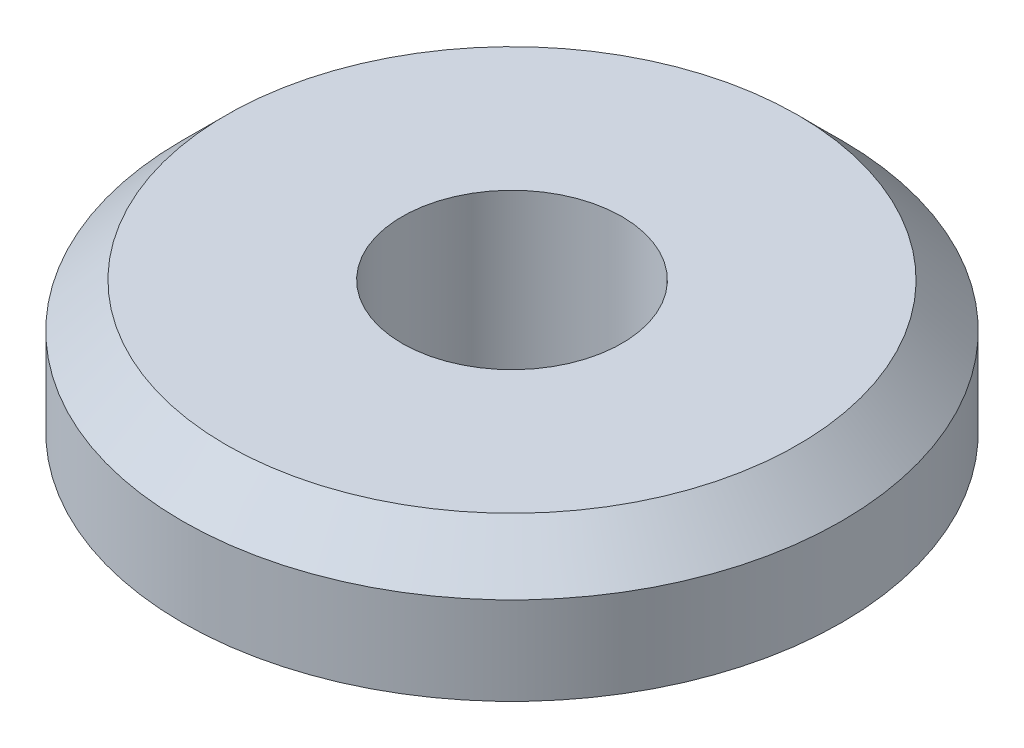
from build123d import *


with BuildPart() as part:
    # Sketch1 → Revolve1 (revolve)
    with BuildSketch(Plane.XY, mode=Mode.PRIVATE) as revolve1_sk:
        Polygon((5, 0), (7.5, 0), (7.5, 5), (15, 5), (15, 9), (13, 11), (7, 11), (5, 11), (5, 9), align=None)
    revolve(revolve1_sk.sketch.rotate(Axis((0, 13.276699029, 0), (0, -1, 0)), 90), axis=Axis((0, 13.276699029, 0), (0, -1, 0)))


solid = part.part
